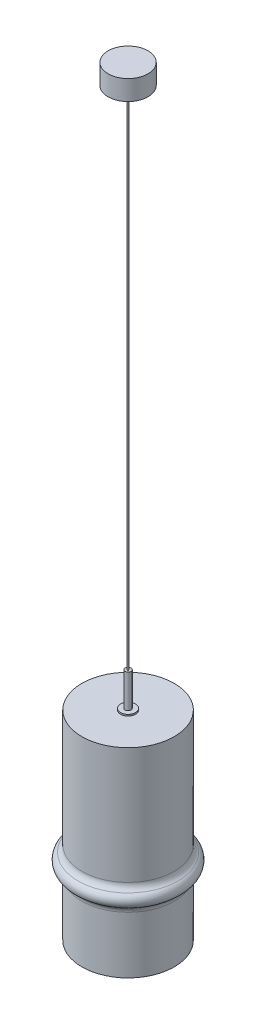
ISO-10303-21;
HEADER;
FILE_DESCRIPTION(('STEP AP214'),'2;1');
FILE_NAME('part.step','',(''),(''),'','','');
FILE_SCHEMA(('AUTOMOTIVE_DESIGN { 1 0 10303 214 1 1 1 1 }'));
ENDSEC;
DATA;
#1=APPLICATION_CONTEXT('core data for automotive mechanical design processes');
#2=APPLICATION_PROTOCOL_DEFINITION('international standard','automotive_design',2000,#1);
#3=PRODUCT_CONTEXT('',#1,'mechanical');
#4=PRODUCT('Part','Part','',(#3));
#5=PRODUCT_RELATED_PRODUCT_CATEGORY('part','',(#4));
#6=PRODUCT_DEFINITION_FORMATION('','',#4);
#7=PRODUCT_DEFINITION_CONTEXT('part definition',#1,'design');
#8=PRODUCT_DEFINITION('design','',#6,#7);
#9=PRODUCT_DEFINITION_SHAPE('','',#8);
#10=(LENGTH_UNIT() NAMED_UNIT(*) SI_UNIT(.MILLI.,.METRE.));
#11=(NAMED_UNIT(*) PLANE_ANGLE_UNIT() SI_UNIT($,.RADIAN.));
#12=(NAMED_UNIT(*) SI_UNIT($,.STERADIAN.) SOLID_ANGLE_UNIT());
#13=UNCERTAINTY_MEASURE_WITH_UNIT(LENGTH_MEASURE(1.E-05),#10,'distance_accuracy_value','');
#14=(GEOMETRIC_REPRESENTATION_CONTEXT(3) GLOBAL_UNCERTAINTY_ASSIGNED_CONTEXT((#13)) GLOBAL_UNIT_ASSIGNED_CONTEXT((#10,
#11,#12)) REPRESENTATION_CONTEXT('',''));
#15=CARTESIAN_POINT('',(0.,0.,0.));
#16=DIRECTION('',(0.,0.,1.));
#17=DIRECTION('',(1.,0.,0.));
#18=AXIS2_PLACEMENT_3D('',#15,#16,#17);
#19=CARTESIAN_POINT('',(-90.8308278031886,231.749248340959,403.));
#20=DIRECTION('',(0.,-1.,0.));
#21=DIRECTION('',(0.,0.,-1.));
#22=AXIS2_PLACEMENT_3D('',#19,#20,#21);
#23=CYLINDRICAL_SURFACE('',#22,15.);
#24=CARTESIAN_POINT('',(-90.8308278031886,231.749248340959,403.));
#25=DIRECTION('',(0.,-1.,0.));
#26=DIRECTION('',(0.,0.,-1.));
#27=AXIS2_PLACEMENT_3D('',#24,#25,#26);
#28=CIRCLE('',#27,15.);
#29=CARTESIAN_POINT('',(-90.8308278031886,231.749248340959,388.));
#30=VERTEX_POINT('',#29);
#31=EDGE_CURVE('P0_E9',#30,#30,#28,.T.);
#32=ORIENTED_EDGE('',*,*,#31,.T.);
#33=EDGE_LOOP('',(#32));
#34=FACE_BOUND('',#33,.T.);
#35=CARTESIAN_POINT('',(-90.8308278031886,228.749248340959,403.));
#36=DIRECTION('',(0.,-1.,0.));
#37=DIRECTION('',(0.,0.,-1.));
#38=AXIS2_PLACEMENT_3D('',#35,#36,#37);
#39=CIRCLE('',#38,15.);
#40=CARTESIAN_POINT('',(-90.8308278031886,228.749248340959,388.));
#41=VERTEX_POINT('',#40);
#42=EDGE_CURVE('P0_E16',#41,#41,#39,.T.);
#43=ORIENTED_EDGE('',*,*,#42,.F.);
#44=EDGE_LOOP('',(#43));
#45=FACE_BOUND('',#44,.T.);
#46=ADVANCED_FACE('P0_F13',(#34,#45),#23,.T.);
#47=CARTESIAN_POINT('',(-90.8308278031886,231.749248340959,403.));
#48=DIRECTION('',(0.,-1.,0.));
#49=DIRECTION('',(0.,0.,-1.));
#50=AXIS2_PLACEMENT_3D('',#47,#48,#49);
#51=PLANE('',#50);
#52=CARTESIAN_POINT('',(-90.8308278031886,231.749248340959,403.));
#53=DIRECTION('',(0.,-1.,0.));
#54=DIRECTION('',(0.,0.,-1.));
#55=AXIS2_PLACEMENT_3D('',#52,#53,#54);
#56=CIRCLE('',#55,6.);
#57=CARTESIAN_POINT('',(-90.8308278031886,231.749248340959,397.));
#58=VERTEX_POINT('',#57);
#59=EDGE_CURVE('P0_E23',#58,#58,#56,.T.);
#60=ORIENTED_EDGE('',*,*,#59,.T.);
#61=EDGE_LOOP('',(#60));
#62=FACE_BOUND('',#61,.T.);
#63=ORIENTED_EDGE('',*,*,#31,.F.);
#64=EDGE_LOOP('',(#63));
#65=FACE_BOUND('',#64,.T.);
#66=ADVANCED_FACE('P0_F31',(#62,#65),#51,.F.);
#67=CARTESIAN_POINT('',(-90.8308278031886,228.749248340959,403.));
#68=DIRECTION('',(0.,-1.,0.));
#69=DIRECTION('',(0.,0.,-1.));
#70=AXIS2_PLACEMENT_3D('',#67,#68,#69);
#71=PLANE('',#70);
#72=CARTESIAN_POINT('',(-90.8308278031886,228.749248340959,403.));
#73=DIRECTION('',(0.,-1.,0.));
#74=DIRECTION('',(0.,0.,-1.));
#75=AXIS2_PLACEMENT_3D('',#72,#73,#74);
#76=CIRCLE('',#75,6.);
#77=CARTESIAN_POINT('',(-90.8308278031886,228.749248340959,397.));
#78=VERTEX_POINT('',#77);
#79=EDGE_CURVE('P0_E25',#78,#78,#76,.T.);
#80=ORIENTED_EDGE('',*,*,#79,.F.);
#81=EDGE_LOOP('',(#80));
#82=FACE_BOUND('',#81,.T.);
#83=ORIENTED_EDGE('',*,*,#42,.T.);
#84=EDGE_LOOP('',(#83));
#85=FACE_BOUND('',#84,.T.);
#86=ADVANCED_FACE('P0_F37',(#82,#85),#71,.T.);
#87=CARTESIAN_POINT('',(-90.8308278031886,231.749248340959,403.));
#88=DIRECTION('',(0.,-1.,0.));
#89=DIRECTION('',(0.,0.,-1.));
#90=AXIS2_PLACEMENT_3D('',#87,#88,#89);
#91=CYLINDRICAL_SURFACE('',#90,6.);
#92=ORIENTED_EDGE('',*,*,#59,.F.);
#93=EDGE_LOOP('',(#92));
#94=FACE_BOUND('',#93,.T.);
#95=ORIENTED_EDGE('',*,*,#79,.T.);
#96=EDGE_LOOP('',(#95));
#97=FACE_BOUND('',#96,.T.);
#98=ADVANCED_FACE('P0_F34',(#94,#97),#91,.F.);
#99=CLOSED_SHELL('',(#46,#66,#86,#98));
#100=MANIFOLD_SOLID_BREP('P0_B1',#99);
#101=CARTESIAN_POINT('',(-90.8308278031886,1353.74924834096,403.));
#102=DIRECTION('',(0.,-1.,0.));
#103=DIRECTION('',(0.,0.,-1.));
#104=AXIS2_PLACEMENT_3D('',#101,#102,#103);
#105=CYLINDRICAL_SURFACE('',#104,40.);
#106=CARTESIAN_POINT('',(-90.8308278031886,1353.74924834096,403.));
#107=DIRECTION('',(0.,1.,0.));
#108=DIRECTION('',(0.,0.,1.));
#109=AXIS2_PLACEMENT_3D('',#106,#107,#108);
#110=CIRCLE('',#109,40.);
#111=CARTESIAN_POINT('',(-90.8308278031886,1353.74924834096,443.));
#112=VERTEX_POINT('',#111);
#113=EDGE_CURVE('P1_E10',#112,#112,#110,.T.);
#114=ORIENTED_EDGE('',*,*,#113,.F.);
#115=EDGE_LOOP('',(#114));
#116=FACE_BOUND('',#115,.T.);
#117=CARTESIAN_POINT('',(-90.8308278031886,1313.74924834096,403.));
#118=DIRECTION('',(0.,1.,0.));
#119=DIRECTION('',(0.,0.,1.));
#120=AXIS2_PLACEMENT_3D('',#117,#118,#119);
#121=CIRCLE('',#120,40.);
#122=CARTESIAN_POINT('',(-90.8308278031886,1313.74924834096,443.));
#123=VERTEX_POINT('',#122);
#124=EDGE_CURVE('P1_E17',#123,#123,#121,.T.);
#125=ORIENTED_EDGE('',*,*,#124,.T.);
#126=EDGE_LOOP('',(#125));
#127=FACE_BOUND('',#126,.T.);
#128=ADVANCED_FACE('P1_F14',(#116,#127),#105,.T.);
#129=CARTESIAN_POINT('',(-90.8308278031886,1353.74924834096,403.));
#130=DIRECTION('',(0.,1.,0.));
#131=DIRECTION('',(0.,0.,1.));
#132=AXIS2_PLACEMENT_3D('',#129,#130,#131);
#133=PLANE('',#132);
#134=ORIENTED_EDGE('',*,*,#113,.T.);
#135=EDGE_LOOP('',(#134));
#136=FACE_BOUND('',#135,.T.);
#137=ADVANCED_FACE('P1_F29',(#136),#133,.T.);
#138=CARTESIAN_POINT('',(-90.8308278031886,1313.74924834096,403.));
#139=DIRECTION('',(0.,1.,0.));
#140=DIRECTION('',(0.,0.,1.));
#141=AXIS2_PLACEMENT_3D('',#138,#139,#140);
#142=PLANE('',#141);
#143=ORIENTED_EDGE('',*,*,#124,.F.);
#144=EDGE_LOOP('',(#143));
#145=FACE_BOUND('',#144,.T.);
#146=ADVANCED_FACE('P1_F27',(#145),#142,.F.);
#147=CLOSED_SHELL('',(#128,#137,#146));
#148=MANIFOLD_SOLID_BREP('P1_B1',#147);
#149=CARTESIAN_POINT('',(-90.8308278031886,1313.74924834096,403.));
#150=DIRECTION('',(0.,-1.,0.));
#151=DIRECTION('',(0.,0.,-1.));
#152=AXIS2_PLACEMENT_3D('',#149,#150,#151);
#153=CYLINDRICAL_SURFACE('',#152,7.5);
#154=CARTESIAN_POINT('',(-90.8308278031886,1313.74924834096,403.));
#155=DIRECTION('',(0.,1.,0.));
#156=DIRECTION('',(0.,0.,1.));
#157=AXIS2_PLACEMENT_3D('',#154,#155,#156);
#158=CIRCLE('',#157,7.5);
#159=CARTESIAN_POINT('',(-90.8308278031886,1313.74924834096,410.5));
#160=VERTEX_POINT('',#159);
#161=EDGE_CURVE('P2_E10',#160,#160,#158,.T.);
#162=ORIENTED_EDGE('',*,*,#161,.F.);
#163=EDGE_LOOP('',(#162));
#164=FACE_BOUND('',#163,.T.);
#165=CARTESIAN_POINT('',(-90.8308278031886,1298.74924834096,403.));
#166=DIRECTION('',(0.,1.,0.));
#167=DIRECTION('',(0.,0.,1.));
#168=AXIS2_PLACEMENT_3D('',#165,#166,#167);
#169=CIRCLE('',#168,7.5);
#170=CARTESIAN_POINT('',(-90.8308278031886,1298.74924834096,410.5));
#171=VERTEX_POINT('',#170);
#172=EDGE_CURVE('P2_E17',#171,#171,#169,.T.);
#173=ORIENTED_EDGE('',*,*,#172,.T.);
#174=EDGE_LOOP('',(#173));
#175=FACE_BOUND('',#174,.T.);
#176=ADVANCED_FACE('P2_F14',(#164,#175),#153,.T.);
#177=CARTESIAN_POINT('',(-90.8308278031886,1313.74924834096,403.));
#178=DIRECTION('',(0.,1.,0.));
#179=DIRECTION('',(0.,0.,1.));
#180=AXIS2_PLACEMENT_3D('',#177,#178,#179);
#181=PLANE('',#180);
#182=ORIENTED_EDGE('',*,*,#161,.T.);
#183=EDGE_LOOP('',(#182));
#184=FACE_BOUND('',#183,.T.);
#185=ADVANCED_FACE('P2_F29',(#184),#181,.T.);
#186=CARTESIAN_POINT('',(-90.8308278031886,1298.74924834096,403.));
#187=DIRECTION('',(0.,1.,0.));
#188=DIRECTION('',(0.,0.,1.));
#189=AXIS2_PLACEMENT_3D('',#186,#187,#188);
#190=PLANE('',#189);
#191=ORIENTED_EDGE('',*,*,#172,.F.);
#192=EDGE_LOOP('',(#191));
#193=FACE_BOUND('',#192,.T.);
#194=ADVANCED_FACE('P2_F27',(#193),#190,.F.);
#195=CLOSED_SHELL('',(#176,#185,#194));
#196=MANIFOLD_SOLID_BREP('P2_B1',#195);
#197=CARTESIAN_POINT('',(-90.8308278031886,1298.74924834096,403.));
#198=DIRECTION('',(0.,-1.,0.));
#199=DIRECTION('',(0.,0.,-1.));
#200=AXIS2_PLACEMENT_3D('',#197,#198,#199);
#201=CYLINDRICAL_SURFACE('',#200,1.5);
#202=CARTESIAN_POINT('',(-90.8308278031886,1298.74924834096,403.));
#203=DIRECTION('',(0.,1.,0.));
#204=DIRECTION('',(0.,0.,1.));
#205=AXIS2_PLACEMENT_3D('',#202,#203,#204);
#206=CIRCLE('',#205,1.5);
#207=CARTESIAN_POINT('',(-90.8308278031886,1298.74924834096,404.5));
#208=VERTEX_POINT('',#207);
#209=EDGE_CURVE('P3_E10',#208,#208,#206,.T.);
#210=ORIENTED_EDGE('',*,*,#209,.F.);
#211=EDGE_LOOP('',(#210));
#212=FACE_BOUND('',#211,.T.);
#213=CARTESIAN_POINT('',(-90.8308278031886,298.749248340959,403.));
#214=DIRECTION('',(0.,1.,0.));
#215=DIRECTION('',(0.,0.,1.));
#216=AXIS2_PLACEMENT_3D('',#213,#214,#215);
#217=CIRCLE('',#216,1.5);
#218=CARTESIAN_POINT('',(-90.8308278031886,298.749248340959,404.5));
#219=VERTEX_POINT('',#218);
#220=EDGE_CURVE('P3_E17',#219,#219,#217,.T.);
#221=ORIENTED_EDGE('',*,*,#220,.T.);
#222=EDGE_LOOP('',(#221));
#223=FACE_BOUND('',#222,.T.);
#224=ADVANCED_FACE('P3_F14',(#212,#223),#201,.T.);
#225=CARTESIAN_POINT('',(-90.8308278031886,1298.74924834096,403.));
#226=DIRECTION('',(0.,1.,0.));
#227=DIRECTION('',(0.,0.,1.));
#228=AXIS2_PLACEMENT_3D('',#225,#226,#227);
#229=PLANE('',#228);
#230=ORIENTED_EDGE('',*,*,#209,.T.);
#231=EDGE_LOOP('',(#230));
#232=FACE_BOUND('',#231,.T.);
#233=ADVANCED_FACE('P3_F29',(#232),#229,.T.);
#234=CARTESIAN_POINT('',(-90.8308278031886,298.749248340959,403.));
#235=DIRECTION('',(0.,1.,0.));
#236=DIRECTION('',(0.,0.,1.));
#237=AXIS2_PLACEMENT_3D('',#234,#235,#236);
#238=PLANE('',#237);
#239=ORIENTED_EDGE('',*,*,#220,.F.);
#240=EDGE_LOOP('',(#239));
#241=FACE_BOUND('',#240,.T.);
#242=ADVANCED_FACE('P3_F27',(#241),#238,.F.);
#243=CLOSED_SHELL('',(#224,#233,#242));
#244=MANIFOLD_SOLID_BREP('P3_B1',#243);
#245=CARTESIAN_POINT('',(-90.8308278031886,298.749248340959,403.));
#246=DIRECTION('',(0.,-1.,0.));
#247=DIRECTION('',(0.,0.,-1.));
#248=AXIS2_PLACEMENT_3D('',#245,#246,#247);
#249=CYLINDRICAL_SURFACE('',#248,6.);
#250=CARTESIAN_POINT('',(-90.8308278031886,298.749248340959,403.));
#251=DIRECTION('',(0.,1.,0.));
#252=DIRECTION('',(0.,0.,1.));
#253=AXIS2_PLACEMENT_3D('',#250,#251,#252);
#254=CIRCLE('',#253,6.);
#255=CARTESIAN_POINT('',(-90.8308278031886,298.749248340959,409.));
#256=VERTEX_POINT('',#255);
#257=EDGE_CURVE('P4_E10',#256,#256,#254,.T.);
#258=ORIENTED_EDGE('',*,*,#257,.F.);
#259=EDGE_LOOP('',(#258));
#260=FACE_BOUND('',#259,.T.);
#261=CARTESIAN_POINT('',(-90.8308278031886,228.749248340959,403.));
#262=DIRECTION('',(0.,1.,0.));
#263=DIRECTION('',(0.,0.,1.));
#264=AXIS2_PLACEMENT_3D('',#261,#262,#263);
#265=CIRCLE('',#264,6.);
#266=CARTESIAN_POINT('',(-90.8308278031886,228.749248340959,409.));
#267=VERTEX_POINT('',#266);
#268=EDGE_CURVE('P4_E17',#267,#267,#265,.T.);
#269=ORIENTED_EDGE('',*,*,#268,.T.);
#270=EDGE_LOOP('',(#269));
#271=FACE_BOUND('',#270,.T.);
#272=ADVANCED_FACE('P4_F14',(#260,#271),#249,.T.);
#273=CARTESIAN_POINT('',(-90.8308278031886,298.749248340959,403.));
#274=DIRECTION('',(0.,1.,0.));
#275=DIRECTION('',(0.,0.,1.));
#276=AXIS2_PLACEMENT_3D('',#273,#274,#275);
#277=PLANE('',#276);
#278=ORIENTED_EDGE('',*,*,#257,.T.);
#279=EDGE_LOOP('',(#278));
#280=FACE_BOUND('',#279,.T.);
#281=ADVANCED_FACE('P4_F29',(#280),#277,.T.);
#282=CARTESIAN_POINT('',(-90.8308278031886,228.749248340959,403.));
#283=DIRECTION('',(0.,1.,0.));
#284=DIRECTION('',(0.,0.,1.));
#285=AXIS2_PLACEMENT_3D('',#282,#283,#284);
#286=PLANE('',#285);
#287=ORIENTED_EDGE('',*,*,#268,.F.);
#288=EDGE_LOOP('',(#287));
#289=FACE_BOUND('',#288,.T.);
#290=ADVANCED_FACE('P4_F27',(#289),#286,.F.);
#291=CLOSED_SHELL('',(#272,#281,#290));
#292=MANIFOLD_SOLID_BREP('P4_B1',#291);
#293=CARTESIAN_POINT('',(-90.8308278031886,-113.307377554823,403.));
#294=DIRECTION('',(0.,-1.,0.));
#295=DIRECTION('',(0.,0.,-1.));
#296=AXIS2_PLACEMENT_3D('',#293,#294,#295);
#297=CYLINDRICAL_SURFACE('',#296,90.);
#298=CARTESIAN_POINT('',(-90.8308278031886,226.109248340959,403.));
#299=DIRECTION('',(0.,1.,0.));
#300=DIRECTION('',(0.,0.,1.));
#301=AXIS2_PLACEMENT_3D('',#298,#299,#300);
#302=CIRCLE('',#301,89.9999999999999);
#303=CARTESIAN_POINT('',(-90.8308278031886,226.109248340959,493.));
#304=VERTEX_POINT('',#303);
#305=EDGE_CURVE('P5_E52',#304,#304,#302,.T.);
#306=ORIENTED_EDGE('',*,*,#305,.T.);
#307=EDGE_LOOP('',(#306));
#308=FACE_BOUND('',#307,.T.);
#309=CARTESIAN_POINT('',(-90.8308278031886,-169.250751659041,403.));
#310=DIRECTION('',(0.,-1.,0.));
#311=DIRECTION('',(0.,0.,-1.));
#312=AXIS2_PLACEMENT_3D('',#309,#310,#311);
#313=CIRCLE('',#312,90.);
#314=CARTESIAN_POINT('',(-90.8308278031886,-169.250751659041,313.));
#315=VERTEX_POINT('',#314);
#316=EDGE_CURVE('P5_E29',#315,#315,#313,.T.);
#317=ORIENTED_EDGE('',*,*,#316,.T.);
#318=EDGE_LOOP('',(#317));
#319=FACE_BOUND('',#318,.T.);
#320=ADVANCED_FACE('P5_F13',(#308,#319),#297,.F.);
#321=CARTESIAN_POINT('',(-0.83082780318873,228.749248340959,403.));
#322=DIRECTION('',(0.,1.,0.));
#323=DIRECTION('',(0.,0.,1.));
#324=AXIS2_PLACEMENT_3D('',#321,#322,#323);
#325=PLANE('',#324);
#326=CARTESIAN_POINT('',(-90.8308278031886,228.749248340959,403.));
#327=DIRECTION('',(0.,-1.,0.));
#328=DIRECTION('',(0.,0.,-1.));
#329=AXIS2_PLACEMENT_3D('',#326,#327,#328);
#330=CIRCLE('',#329,92.64);
#331=CARTESIAN_POINT('',(-90.8308278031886,228.749248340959,310.36));
#332=VERTEX_POINT('',#331);
#333=EDGE_CURVE('P5_E59',#332,#332,#330,.T.);
#334=ORIENTED_EDGE('',*,*,#333,.F.);
#335=EDGE_LOOP('',(#334));
#336=FACE_BOUND('',#335,.T.);
#337=CARTESIAN_POINT('',(-90.8308278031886,228.749248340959,403.));
#338=DIRECTION('',(0.,1.,0.));
#339=DIRECTION('',(0.,0.,1.));
#340=AXIS2_PLACEMENT_3D('',#337,#338,#339);
#341=CIRCLE('',#340,5.);
#342=CARTESIAN_POINT('',(-90.8308278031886,228.749248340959,408.));
#343=VERTEX_POINT('',#342);
#344=EDGE_CURVE('P5_E31',#343,#343,#341,.T.);
#345=ORIENTED_EDGE('',*,*,#344,.F.);
#346=EDGE_LOOP('',(#345));
#347=FACE_BOUND('',#346,.T.);
#348=ADVANCED_FACE('P5_F84',(#336,#347),#325,.T.);
#349=CARTESIAN_POINT('',(1.80917219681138,-171.250751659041,403.));
#350=DIRECTION('',(0.,-1.,0.));
#351=DIRECTION('',(0.,0.,-1.));
#352=AXIS2_PLACEMENT_3D('',#349,#350,#351);
#353=PLANE('',#352);
#354=CARTESIAN_POINT('',(-90.8308278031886,-171.250751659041,403.));
#355=DIRECTION('',(0.,-1.,0.));
#356=DIRECTION('',(0.,0.,-1.));
#357=AXIS2_PLACEMENT_3D('',#354,#355,#356);
#358=CIRCLE('',#357,76.3058915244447);
#359=CARTESIAN_POINT('',(-90.8308278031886,-171.250751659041,326.694108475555));
#360=VERTEX_POINT('',#359);
#361=EDGE_CURVE('P5_E47',#360,#360,#358,.T.);
#362=ORIENTED_EDGE('',*,*,#361,.F.);
#363=EDGE_LOOP('',(#362));
#364=FACE_BOUND('',#363,.T.);
#365=CARTESIAN_POINT('',(-90.8308278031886,-171.250751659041,403.));
#366=DIRECTION('',(0.,-1.,0.));
#367=DIRECTION('',(0.,0.,-1.));
#368=AXIS2_PLACEMENT_3D('',#365,#366,#367);
#369=CIRCLE('',#368,92.64);
#370=CARTESIAN_POINT('',(-90.8308278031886,-171.250751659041,310.36));
#371=VERTEX_POINT('',#370);
#372=EDGE_CURVE('P5_E56',#371,#371,#369,.T.);
#373=ORIENTED_EDGE('',*,*,#372,.T.);
#374=EDGE_LOOP('',(#373));
#375=FACE_BOUND('',#374,.T.);
#376=ADVANCED_FACE('P5_F90',(#364,#375),#353,.T.);
#377=CARTESIAN_POINT('',(-90.8308278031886,-113.307377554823,403.));
#378=DIRECTION('',(0.,-1.,0.));
#379=DIRECTION('',(0.,0.,-1.));
#380=AXIS2_PLACEMENT_3D('',#377,#378,#379);
#381=CYLINDRICAL_SURFACE('',#380,92.64);
#382=CARTESIAN_POINT('',(-90.8308278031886,-57.2315137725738,403.));
#383=DIRECTION('',(0.,-1.,0.));
#384=DIRECTION('',(0.,0.,-1.));
#385=AXIS2_PLACEMENT_3D('',#382,#383,#384);
#386=CIRCLE('',#385,92.64);
#387=CARTESIAN_POINT('',(-90.8308278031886,-57.2315137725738,310.36));
#388=VERTEX_POINT('',#387);
#389=EDGE_CURVE('P5_E62',#388,#388,#386,.T.);
#390=ORIENTED_EDGE('',*,*,#389,.T.);
#391=EDGE_LOOP('',(#390));
#392=FACE_BOUND('',#391,.T.);
#393=ORIENTED_EDGE('',*,*,#372,.F.);
#394=EDGE_LOOP('',(#393));
#395=FACE_BOUND('',#394,.T.);
#396=ADVANCED_FACE('P5_F96',(#392,#395),#381,.T.);
#397=CARTESIAN_POINT('',(-90.8308278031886,-31.2507516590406,403.));
#398=DIRECTION('',(0.,-1.,0.));
#399=DIRECTION('',(0.,0.,-1.));
#400=AXIS2_PLACEMENT_3D('',#397,#398,#399);
#401=TOROIDAL_SURFACE('',#400,92.64,15.);
#402=CARTESIAN_POINT('',(-90.8308278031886,-44.2411327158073,403.));
#403=DIRECTION('',(0.,1.,0.));
#404=DIRECTION('',(0.,0.,1.));
#405=AXIS2_PLACEMENT_3D('',#402,#403,#404);
#406=CIRCLE('',#405,100.14);
#407=CARTESIAN_POINT('',(-90.8308278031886,-44.2411327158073,503.14));
#408=VERTEX_POINT('',#407);
#409=EDGE_CURVE('P5_E21',#408,#408,#406,.T.);
#410=ORIENTED_EDGE('',*,*,#409,.T.);
#411=EDGE_LOOP('',(#410));
#412=FACE_BOUND('',#411,.T.);
#413=CARTESIAN_POINT('',(-90.8308278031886,-18.2603706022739,403.));
#414=DIRECTION('',(0.,-1.,0.));
#415=DIRECTION('',(0.,0.,-1.));
#416=AXIS2_PLACEMENT_3D('',#413,#414,#415);
#417=CIRCLE('',#416,100.14);
#418=CARTESIAN_POINT('',(-90.8308278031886,-18.2603706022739,302.86));
#419=VERTEX_POINT('',#418);
#420=EDGE_CURVE('P5_E26',#419,#419,#417,.T.);
#421=ORIENTED_EDGE('',*,*,#420,.T.);
#422=EDGE_LOOP('',(#421));
#423=FACE_BOUND('',#422,.T.);
#424=ADVANCED_FACE('P5_F67',(#412,#423),#401,.T.);
#425=CARTESIAN_POINT('',(-90.8308278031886,-113.307377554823,403.));
#426=DIRECTION('',(0.,-1.,0.));
#427=DIRECTION('',(0.,0.,-1.));
#428=AXIS2_PLACEMENT_3D('',#425,#426,#427);
#429=CYLINDRICAL_SURFACE('',#428,92.64);
#430=CARTESIAN_POINT('',(-90.8308278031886,-5.26998954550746,403.));
#431=DIRECTION('',(0.,-1.,0.));
#432=DIRECTION('',(0.,0.,-1.));
#433=AXIS2_PLACEMENT_3D('',#430,#431,#432);
#434=CIRCLE('',#433,92.64);
#435=CARTESIAN_POINT('',(-90.8308278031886,-5.26998954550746,310.36));
#436=VERTEX_POINT('',#435);
#437=EDGE_CURVE('P5_E9',#436,#436,#434,.F.);
#438=ORIENTED_EDGE('',*,*,#437,.T.);
#439=EDGE_LOOP('',(#438));
#440=FACE_BOUND('',#439,.T.);
#441=ORIENTED_EDGE('',*,*,#333,.T.);
#442=EDGE_LOOP('',(#441));
#443=FACE_BOUND('',#442,.T.);
#444=ADVANCED_FACE('P5_F81',(#440,#443),#429,.T.);
#445=CARTESIAN_POINT('',(-90.8308278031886,-57.2315137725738,403.));
#446=DIRECTION('',(0.,-1.,0.));
#447=DIRECTION('',(0.,0.,-1.));
#448=AXIS2_PLACEMENT_3D('',#445,#446,#447);
#449=TOROIDAL_SURFACE('',#448,107.64,15.);
#450=ORIENTED_EDGE('',*,*,#409,.F.);
#451=EDGE_LOOP('',(#450));
#452=FACE_BOUND('',#451,.T.);
#453=ORIENTED_EDGE('',*,*,#389,.F.);
#454=EDGE_LOOP('',(#453));
#455=FACE_BOUND('',#454,.T.);
#456=ADVANCED_FACE('P5_F71',(#452,#455),#449,.F.);
#457=CARTESIAN_POINT('',(-90.8308278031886,-5.26998954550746,403.));
#458=DIRECTION('',(0.,-1.,0.));
#459=DIRECTION('',(0.,0.,-1.));
#460=AXIS2_PLACEMENT_3D('',#457,#458,#459);
#461=TOROIDAL_SURFACE('',#460,107.64,15.);
#462=ORIENTED_EDGE('',*,*,#437,.F.);
#463=EDGE_LOOP('',(#462));
#464=FACE_BOUND('',#463,.T.);
#465=ORIENTED_EDGE('',*,*,#420,.F.);
#466=EDGE_LOOP('',(#465));
#467=FACE_BOUND('',#466,.T.);
#468=ADVANCED_FACE('P5_F15',(#464,#467),#461,.F.);
#469=CARTESIAN_POINT('',(-90.8308278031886,226.109248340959,403.));
#470=DIRECTION('',(0.,1.,0.));
#471=DIRECTION('',(0.,0.,1.));
#472=AXIS2_PLACEMENT_3D('',#469,#470,#471);
#473=PLANE('',#472);
#474=CARTESIAN_POINT('',(-90.8308278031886,226.109248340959,403.));
#475=DIRECTION('',(0.,1.,0.));
#476=DIRECTION('',(0.,0.,1.));
#477=AXIS2_PLACEMENT_3D('',#474,#475,#476);
#478=CIRCLE('',#477,5.);
#479=CARTESIAN_POINT('',(-90.8308278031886,226.109248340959,408.));
#480=VERTEX_POINT('',#479);
#481=EDGE_CURVE('P5_E35',#480,#480,#478,.T.);
#482=ORIENTED_EDGE('',*,*,#481,.T.);
#483=EDGE_LOOP('',(#482));
#484=FACE_BOUND('',#483,.T.);
#485=ORIENTED_EDGE('',*,*,#305,.F.);
#486=EDGE_LOOP('',(#485));
#487=FACE_BOUND('',#486,.T.);
#488=ADVANCED_FACE('P5_F70',(#484,#487),#473,.F.);
#489=CARTESIAN_POINT('',(-90.8308278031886,226.109248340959,403.));
#490=DIRECTION('',(0.,1.,0.));
#491=DIRECTION('',(0.,0.,1.));
#492=AXIS2_PLACEMENT_3D('',#489,#490,#491);
#493=CYLINDRICAL_SURFACE('',#492,5.);
#494=ORIENTED_EDGE('',*,*,#481,.F.);
#495=EDGE_LOOP('',(#494));
#496=FACE_BOUND('',#495,.T.);
#497=ORIENTED_EDGE('',*,*,#344,.T.);
#498=EDGE_LOOP('',(#497));
#499=FACE_BOUND('',#498,.T.);
#500=ADVANCED_FACE('P5_F78',(#496,#499),#493,.F.);
#501=CARTESIAN_POINT('',(-90.8308278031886,-169.250751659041,403.));
#502=DIRECTION('',(0.,-1.,0.));
#503=DIRECTION('',(0.,0.,-1.));
#504=AXIS2_PLACEMENT_3D('',#501,#502,#503);
#505=PLANE('',#504);
#506=CARTESIAN_POINT('',(-90.8308278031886,-169.250751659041,403.));
#507=DIRECTION('',(0.,-1.,0.));
#508=DIRECTION('',(0.,0.,-1.));
#509=AXIS2_PLACEMENT_3D('',#506,#507,#508);
#510=CIRCLE('',#509,82.5027488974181);
#511=CARTESIAN_POINT('',(-90.8308278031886,-169.250751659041,320.497251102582));
#512=VERTEX_POINT('',#511);
#513=EDGE_CURVE('P5_E17',#512,#512,#510,.T.);
#514=ORIENTED_EDGE('',*,*,#513,.T.);
#515=EDGE_LOOP('',(#514));
#516=FACE_BOUND('',#515,.T.);
#517=ORIENTED_EDGE('',*,*,#316,.F.);
#518=EDGE_LOOP('',(#517));
#519=FACE_BOUND('',#518,.T.);
#520=ADVANCED_FACE('P5_F108',(#516,#519),#505,.F.);
#521=CARTESIAN_POINT('',(-90.8308278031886,-137.250751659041,403.));
#522=DIRECTION('',(0.,-1.,0.));
#523=DIRECTION('',(0.,0.,-1.));
#524=AXIS2_PLACEMENT_3D('',#521,#522,#523);
#525=CYLINDRICAL_SURFACE('',#524,82.5027488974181);
#526=CARTESIAN_POINT('',(-90.8308278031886,-137.250751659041,403.));
#527=DIRECTION('',(0.,-1.,0.));
#528=DIRECTION('',(0.,0.,-1.));
#529=AXIS2_PLACEMENT_3D('',#526,#527,#528);
#530=CIRCLE('',#529,82.5027488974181);
#531=CARTESIAN_POINT('',(-90.8308278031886,-137.250751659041,320.497251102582));
#532=VERTEX_POINT('',#531);
#533=EDGE_CURVE('P5_E38',#532,#532,#530,.T.);
#534=ORIENTED_EDGE('',*,*,#533,.T.);
#535=EDGE_LOOP('',(#534));
#536=FACE_BOUND('',#535,.T.);
#537=ORIENTED_EDGE('',*,*,#513,.F.);
#538=EDGE_LOOP('',(#537));
#539=FACE_BOUND('',#538,.T.);
#540=ADVANCED_FACE('P5_F112',(#536,#539),#525,.T.);
#541=CARTESIAN_POINT('',(-90.8308278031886,-137.250751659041,403.));
#542=DIRECTION('',(0.,-1.,0.));
#543=DIRECTION('',(0.,0.,-1.));
#544=AXIS2_PLACEMENT_3D('',#541,#542,#543);
#545=PLANE('',#544);
#546=ORIENTED_EDGE('',*,*,#533,.F.);
#547=EDGE_LOOP('',(#546));
#548=FACE_BOUND('',#547,.T.);
#549=ADVANCED_FACE('P5_F115',(#548),#545,.F.);
#550=CARTESIAN_POINT('',(-90.8308278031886,-161.250751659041,403.));
#551=DIRECTION('',(0.,-1.,0.));
#552=DIRECTION('',(0.,0.,-1.));
#553=AXIS2_PLACEMENT_3D('',#550,#551,#552);
#554=CYLINDRICAL_SURFACE('',#553,76.3058915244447);
#555=CARTESIAN_POINT('',(-90.8308278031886,-161.250751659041,403.));
#556=DIRECTION('',(0.,-1.,0.));
#557=DIRECTION('',(0.,0.,-1.));
#558=AXIS2_PLACEMENT_3D('',#555,#556,#557);
#559=CIRCLE('',#558,76.3058915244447);
#560=CARTESIAN_POINT('',(-90.8308278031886,-161.250751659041,326.694108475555));
#561=VERTEX_POINT('',#560);
#562=EDGE_CURVE('P5_E42',#561,#561,#559,.T.);
#563=ORIENTED_EDGE('',*,*,#562,.F.);
#564=EDGE_LOOP('',(#563));
#565=FACE_BOUND('',#564,.T.);
#566=ORIENTED_EDGE('',*,*,#361,.T.);
#567=EDGE_LOOP('',(#566));
#568=FACE_BOUND('',#567,.T.);
#569=ADVANCED_FACE('P5_F118',(#565,#568),#554,.F.);
#570=CARTESIAN_POINT('',(-90.8308278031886,-161.250751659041,403.));
#571=DIRECTION('',(0.,-1.,0.));
#572=DIRECTION('',(0.,0.,-1.));
#573=AXIS2_PLACEMENT_3D('',#570,#571,#572);
#574=PLANE('',#573);
#575=CARTESIAN_POINT('',(-90.8308278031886,-161.250751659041,403.));
#576=DIRECTION('',(0.,-1.,0.));
#577=DIRECTION('',(0.,0.,-1.));
#578=AXIS2_PLACEMENT_3D('',#575,#576,#577);
#579=CIRCLE('',#578,56.3315990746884);
#580=CARTESIAN_POINT('',(-90.8308278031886,-161.250751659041,346.668400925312));
#581=VERTEX_POINT('',#580);
#582=EDGE_CURVE('P5_E150',#581,#581,#579,.T.);
#583=ORIENTED_EDGE('',*,*,#582,.F.);
#584=EDGE_LOOP('',(#583));
#585=FACE_BOUND('',#584,.T.);
#586=ORIENTED_EDGE('',*,*,#562,.T.);
#587=EDGE_LOOP('',(#586));
#588=FACE_BOUND('',#587,.T.);
#589=ADVANCED_FACE('P5_F122',(#585,#588),#574,.T.);
#590=CARTESIAN_POINT('',(-90.8308278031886,-173.250751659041,403.));
#591=DIRECTION('',(0.,1.,0.));
#592=DIRECTION('',(0.,0.,1.));
#593=AXIS2_PLACEMENT_3D('',#590,#591,#592);
#594=CYLINDRICAL_SURFACE('',#593,56.3315990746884);
#595=CARTESIAN_POINT('',(-90.8308278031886,-173.250751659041,403.));
#596=DIRECTION('',(0.,-1.,0.));
#597=DIRECTION('',(0.,0.,-1.));
#598=AXIS2_PLACEMENT_3D('',#595,#596,#597);
#599=CIRCLE('',#598,56.3315990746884);
#600=CARTESIAN_POINT('',(-90.8308278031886,-173.250751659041,346.668400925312));
#601=VERTEX_POINT('',#600);
#602=EDGE_CURVE('P5_E153',#601,#601,#599,.T.);
#603=ORIENTED_EDGE('',*,*,#602,.F.);
#604=EDGE_LOOP('',(#603));
#605=FACE_BOUND('',#604,.T.);
#606=ORIENTED_EDGE('',*,*,#582,.T.);
#607=EDGE_LOOP('',(#606));
#608=FACE_BOUND('',#607,.T.);
#609=ADVANCED_FACE('P5_F126',(#605,#608),#594,.T.);
#610=CARTESIAN_POINT('',(-90.8308278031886,-173.250751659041,403.));
#611=DIRECTION('',(0.,-1.,0.));
#612=DIRECTION('',(0.,0.,-1.));
#613=AXIS2_PLACEMENT_3D('',#610,#611,#612);
#614=PLANE('',#613);
#615=CARTESIAN_POINT('',(-90.8308278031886,-173.250751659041,403.));
#616=DIRECTION('',(0.,-1.,0.));
#617=DIRECTION('',(0.,0.,-1.));
#618=AXIS2_PLACEMENT_3D('',#615,#616,#617);
#619=CIRCLE('',#618,54.1015617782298);
#620=CARTESIAN_POINT('',(-90.8308278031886,-173.250751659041,348.89843822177));
#621=VERTEX_POINT('',#620);
#622=EDGE_CURVE('P5_E147',#621,#621,#619,.T.);
#623=ORIENTED_EDGE('',*,*,#622,.F.);
#624=EDGE_LOOP('',(#623));
#625=FACE_BOUND('',#624,.T.);
#626=ORIENTED_EDGE('',*,*,#602,.T.);
#627=EDGE_LOOP('',(#626));
#628=FACE_BOUND('',#627,.T.);
#629=ADVANCED_FACE('P5_F130',(#625,#628),#614,.T.);
#630=CARTESIAN_POINT('',(-90.8308278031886,-168.250751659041,403.));
#631=DIRECTION('',(0.,-1.,0.));
#632=DIRECTION('',(0.,0.,-1.));
#633=AXIS2_PLACEMENT_3D('',#630,#631,#632);
#634=CYLINDRICAL_SURFACE('',#633,54.1015617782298);
#635=CARTESIAN_POINT('',(-90.8308278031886,-169.250751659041,403.));
#636=DIRECTION('',(0.,-1.,0.));
#637=DIRECTION('',(0.,0.,-1.));
#638=AXIS2_PLACEMENT_3D('',#635,#636,#637);
#639=CIRCLE('',#638,54.1015617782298);
#640=CARTESIAN_POINT('',(-90.8308278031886,-169.250751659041,348.89843822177));
#641=VERTEX_POINT('',#640);
#642=EDGE_CURVE('P5_E146',#641,#641,#639,.T.);
#643=ORIENTED_EDGE('',*,*,#642,.F.);
#644=EDGE_LOOP('',(#643));
#645=FACE_BOUND('',#644,.T.);
#646=ORIENTED_EDGE('',*,*,#622,.T.);
#647=EDGE_LOOP('',(#646));
#648=FACE_BOUND('',#647,.T.);
#649=ADVANCED_FACE('P5_F134',(#645,#648),#634,.F.);
#650=CARTESIAN_POINT('',(-90.8308278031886,-169.250751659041,403.));
#651=DIRECTION('',(0.,-1.,0.));
#652=DIRECTION('',(0.,0.,-1.));
#653=AXIS2_PLACEMENT_3D('',#650,#651,#652);
#654=PLANE('',#653);
#655=ORIENTED_EDGE('',*,*,#642,.T.);
#656=EDGE_LOOP('',(#655));
#657=FACE_BOUND('',#656,.T.);
#658=ADVANCED_FACE('P5_F138',(#657),#654,.T.);
#659=CLOSED_SHELL('',(#320,#348,#376,#396,#424,#444,#456,#468,#488,#500,#520,#540,#549,#569,
#589,#609,#629,#649,#658));
#660=MANIFOLD_SOLID_BREP('P5_B1',#659);
#661=ADVANCED_BREP_SHAPE_REPRESENTATION('',(#18,#100,#148,#196,#244,#292,#660),#14);
#662=SHAPE_DEFINITION_REPRESENTATION(#9,#661);
ENDSEC;
END-ISO-10303-21;
